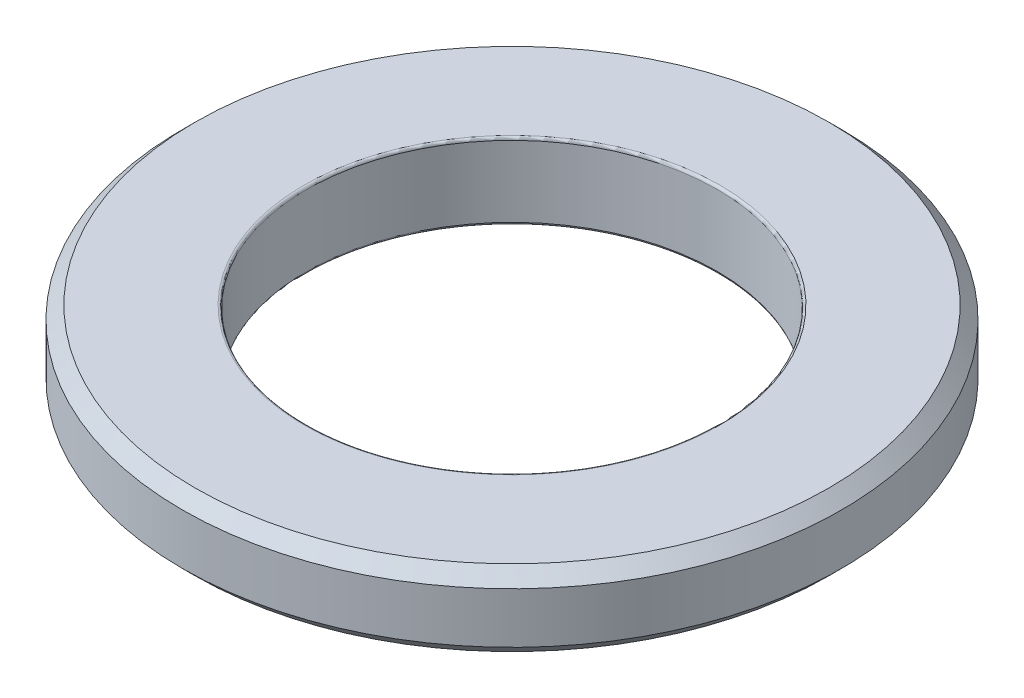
ISO-10303-21;
HEADER;
FILE_DESCRIPTION(('STEP AP214'),'2;1');
FILE_NAME('part.step','',(''),(''),'','','');
FILE_SCHEMA(('AUTOMOTIVE_DESIGN { 1 0 10303 214 1 1 1 1 }'));
ENDSEC;
DATA;
#1=APPLICATION_CONTEXT('core data for automotive mechanical design processes');
#2=APPLICATION_PROTOCOL_DEFINITION('international standard','automotive_design',2000,#1);
#3=PRODUCT_CONTEXT('',#1,'mechanical');
#4=PRODUCT('Part','Part','',(#3));
#5=PRODUCT_RELATED_PRODUCT_CATEGORY('part','',(#4));
#6=PRODUCT_DEFINITION_FORMATION('','',#4);
#7=PRODUCT_DEFINITION_CONTEXT('part definition',#1,'design');
#8=PRODUCT_DEFINITION('design','',#6,#7);
#9=PRODUCT_DEFINITION_SHAPE('','',#8);
#10=(LENGTH_UNIT() NAMED_UNIT(*) SI_UNIT(.MILLI.,.METRE.));
#11=(NAMED_UNIT(*) PLANE_ANGLE_UNIT() SI_UNIT($,.RADIAN.));
#12=(NAMED_UNIT(*) SI_UNIT($,.STERADIAN.) SOLID_ANGLE_UNIT());
#13=UNCERTAINTY_MEASURE_WITH_UNIT(LENGTH_MEASURE(1.E-05),#10,'distance_accuracy_value','');
#14=(GEOMETRIC_REPRESENTATION_CONTEXT(3) GLOBAL_UNCERTAINTY_ASSIGNED_CONTEXT((#13)) GLOBAL_UNIT_ASSIGNED_CONTEXT((#10,
#11,#12)) REPRESENTATION_CONTEXT('',''));
#15=CARTESIAN_POINT('',(0.,0.,0.));
#16=DIRECTION('',(0.,0.,1.));
#17=DIRECTION('',(1.,0.,0.));
#18=AXIS2_PLACEMENT_3D('',#15,#16,#17);
#19=CARTESIAN_POINT('',(0.,0.,0.));
#20=DIRECTION('',(0.,-1.,0.));
#21=DIRECTION('',(0.,0.,-1.));
#22=AXIS2_PLACEMENT_3D('',#19,#20,#21);
#23=CYLINDRICAL_SURFACE('',#22,8.1);
#24=CARTESIAN_POINT('',(0.,0.100000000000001,0.));
#25=DIRECTION('',(0.,1.,0.));
#26=DIRECTION('',(0.,0.,1.));
#27=AXIS2_PLACEMENT_3D('',#24,#25,#26);
#28=CIRCLE('',#27,8.1);
#29=CARTESIAN_POINT('',(0.,0.100000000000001,8.1));
#30=VERTEX_POINT('',#29);
#31=EDGE_CURVE('E62',#30,#30,#28,.F.);
#32=ORIENTED_EDGE('',*,*,#31,.T.);
#33=EDGE_LOOP('',(#32));
#34=FACE_BOUND('',#33,.T.);
#35=CARTESIAN_POINT('',(0.,2.9,0.));
#36=DIRECTION('',(0.,-1.,0.));
#37=DIRECTION('',(0.,0.,-1.));
#38=AXIS2_PLACEMENT_3D('',#35,#36,#37);
#39=CIRCLE('',#38,8.1);
#40=CARTESIAN_POINT('',(0.,2.9,-8.1));
#41=VERTEX_POINT('',#40);
#42=EDGE_CURVE('E65',#41,#41,#39,.F.);
#43=ORIENTED_EDGE('',*,*,#42,.T.);
#44=EDGE_LOOP('',(#43));
#45=FACE_BOUND('',#44,.T.);
#46=ADVANCED_FACE('F36',(#34,#45),#23,.F.);
#47=CARTESIAN_POINT('',(-8.1,0.,0.));
#48=DIRECTION('',(0.,1.,0.));
#49=DIRECTION('',(0.,0.,1.));
#50=AXIS2_PLACEMENT_3D('',#47,#48,#49);
#51=PLANE('',#50);
#52=CARTESIAN_POINT('',(0.,0.,0.));
#53=DIRECTION('',(0.,1.,0.));
#54=DIRECTION('',(0.,0.,1.));
#55=AXIS2_PLACEMENT_3D('',#52,#53,#54);
#56=CIRCLE('',#55,12.5);
#57=CARTESIAN_POINT('',(0.,0.,12.5));
#58=VERTEX_POINT('',#57);
#59=EDGE_CURVE('E51',#58,#58,#56,.F.);
#60=ORIENTED_EDGE('',*,*,#59,.T.);
#61=EDGE_LOOP('',(#60));
#62=FACE_BOUND('',#61,.T.);
#63=CARTESIAN_POINT('',(0.,0.,0.));
#64=DIRECTION('',(0.,1.,0.));
#65=DIRECTION('',(0.,0.,1.));
#66=AXIS2_PLACEMENT_3D('',#63,#64,#65);
#67=CIRCLE('',#66,8.2);
#68=CARTESIAN_POINT('',(0.,0.,8.2));
#69=VERTEX_POINT('',#68);
#70=EDGE_CURVE('E59',#69,#69,#67,.T.);
#71=ORIENTED_EDGE('',*,*,#70,.T.);
#72=EDGE_LOOP('',(#71));
#73=FACE_BOUND('',#72,.T.);
#74=ADVANCED_FACE('F88',(#62,#73),#51,.F.);
#75=CARTESIAN_POINT('',(0.,0.,0.));
#76=DIRECTION('',(0.,-1.,0.));
#77=DIRECTION('',(0.,0.,-1.));
#78=AXIS2_PLACEMENT_3D('',#75,#76,#77);
#79=CYLINDRICAL_SURFACE('',#78,13.);
#80=CARTESIAN_POINT('',(0.,0.500000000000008,0.));
#81=DIRECTION('',(0.,1.,0.));
#82=DIRECTION('',(0.,0.,1.));
#83=AXIS2_PLACEMENT_3D('',#80,#81,#82);
#84=CIRCLE('',#83,13.);
#85=CARTESIAN_POINT('',(0.,0.500000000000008,13.));
#86=VERTEX_POINT('',#85);
#87=EDGE_CURVE('E43',#86,#86,#84,.T.);
#88=ORIENTED_EDGE('',*,*,#87,.T.);
#89=EDGE_LOOP('',(#88));
#90=FACE_BOUND('',#89,.T.);
#91=CARTESIAN_POINT('',(0.,2.5,0.));
#92=DIRECTION('',(0.,-1.,0.));
#93=DIRECTION('',(0.,0.,-1.));
#94=AXIS2_PLACEMENT_3D('',#91,#92,#93);
#95=CIRCLE('',#94,13.);
#96=CARTESIAN_POINT('',(0.,2.5,-13.));
#97=VERTEX_POINT('',#96);
#98=EDGE_CURVE('E47',#97,#97,#95,.T.);
#99=ORIENTED_EDGE('',*,*,#98,.T.);
#100=EDGE_LOOP('',(#99));
#101=FACE_BOUND('',#100,.T.);
#102=ADVANCED_FACE('F80',(#90,#101),#79,.T.);
#103=CARTESIAN_POINT('',(-13.,3.,0.));
#104=DIRECTION('',(0.,-1.,0.));
#105=DIRECTION('',(0.,0.,-1.));
#106=AXIS2_PLACEMENT_3D('',#103,#104,#105);
#107=PLANE('',#106);
#108=CARTESIAN_POINT('',(0.,3.,0.));
#109=DIRECTION('',(0.,-1.,0.));
#110=DIRECTION('',(0.,0.,-1.));
#111=AXIS2_PLACEMENT_3D('',#108,#109,#110);
#112=CIRCLE('',#111,12.5);
#113=CARTESIAN_POINT('',(0.,3.,-12.5));
#114=VERTEX_POINT('',#113);
#115=EDGE_CURVE('E10',#114,#114,#112,.F.);
#116=ORIENTED_EDGE('',*,*,#115,.T.);
#117=EDGE_LOOP('',(#116));
#118=FACE_BOUND('',#117,.T.);
#119=CARTESIAN_POINT('',(0.,3.,0.));
#120=DIRECTION('',(0.,-1.,0.));
#121=DIRECTION('',(0.,0.,-1.));
#122=AXIS2_PLACEMENT_3D('',#119,#120,#121);
#123=CIRCLE('',#122,8.2);
#124=CARTESIAN_POINT('',(0.,3.,-8.2));
#125=VERTEX_POINT('',#124);
#126=EDGE_CURVE('E56',#125,#125,#123,.T.);
#127=ORIENTED_EDGE('',*,*,#126,.T.);
#128=EDGE_LOOP('',(#127));
#129=FACE_BOUND('',#128,.T.);
#130=ADVANCED_FACE('F78',(#118,#129),#107,.F.);
#131=CARTESIAN_POINT('',(0.,0.100000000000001,0.));
#132=DIRECTION('',(0.,1.,0.));
#133=DIRECTION('',(0.,0.,1.));
#134=AXIS2_PLACEMENT_3D('',#131,#132,#133);
#135=TOROIDAL_SURFACE('',#134,8.2,0.1);
#136=ORIENTED_EDGE('',*,*,#70,.F.);
#137=EDGE_LOOP('',(#136));
#138=FACE_BOUND('',#137,.T.);
#139=ORIENTED_EDGE('',*,*,#31,.F.);
#140=EDGE_LOOP('',(#139));
#141=FACE_BOUND('',#140,.T.);
#142=ADVANCED_FACE('F74',(#138,#141),#135,.T.);
#143=CARTESIAN_POINT('',(0.,2.9,0.));
#144=DIRECTION('',(0.,-1.,0.));
#145=DIRECTION('',(0.,0.,-1.));
#146=AXIS2_PLACEMENT_3D('',#143,#144,#145);
#147=TOROIDAL_SURFACE('',#146,8.2,0.1);
#148=ORIENTED_EDGE('',*,*,#42,.F.);
#149=EDGE_LOOP('',(#148));
#150=FACE_BOUND('',#149,.T.);
#151=ORIENTED_EDGE('',*,*,#126,.F.);
#152=EDGE_LOOP('',(#151));
#153=FACE_BOUND('',#152,.T.);
#154=ADVANCED_FACE('F70',(#150,#153),#147,.T.);
#155=CARTESIAN_POINT('',(0.,0.,0.));
#156=DIRECTION('',(0.,1.,0.));
#157=DIRECTION('',(0.,0.,1.));
#158=AXIS2_PLACEMENT_3D('',#155,#156,#157);
#159=CONICAL_SURFACE('',#158,12.5,0.785398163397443);
#160=ORIENTED_EDGE('',*,*,#87,.F.);
#161=EDGE_LOOP('',(#160));
#162=FACE_BOUND('',#161,.T.);
#163=ORIENTED_EDGE('',*,*,#59,.F.);
#164=EDGE_LOOP('',(#163));
#165=FACE_BOUND('',#164,.T.);
#166=ADVANCED_FACE('F73',(#162,#165),#159,.T.);
#167=CARTESIAN_POINT('',(0.,2.5,0.));
#168=DIRECTION('',(0.,-1.,0.));
#169=DIRECTION('',(0.,0.,-1.));
#170=AXIS2_PLACEMENT_3D('',#167,#168,#169);
#171=CONICAL_SURFACE('',#170,13.,0.78539816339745);
#172=ORIENTED_EDGE('',*,*,#115,.F.);
#173=EDGE_LOOP('',(#172));
#174=FACE_BOUND('',#173,.T.);
#175=ORIENTED_EDGE('',*,*,#98,.F.);
#176=EDGE_LOOP('',(#175));
#177=FACE_BOUND('',#176,.T.);
#178=ADVANCED_FACE('F38',(#174,#177),#171,.T.);
#179=CLOSED_SHELL('',(#46,#74,#102,#130,#142,#154,#166,#178));
#180=MANIFOLD_SOLID_BREP('B2',#179);
#181=ADVANCED_BREP_SHAPE_REPRESENTATION('',(#18,#180),#14);
#182=SHAPE_DEFINITION_REPRESENTATION(#9,#181);
ENDSEC;
END-ISO-10303-21;
